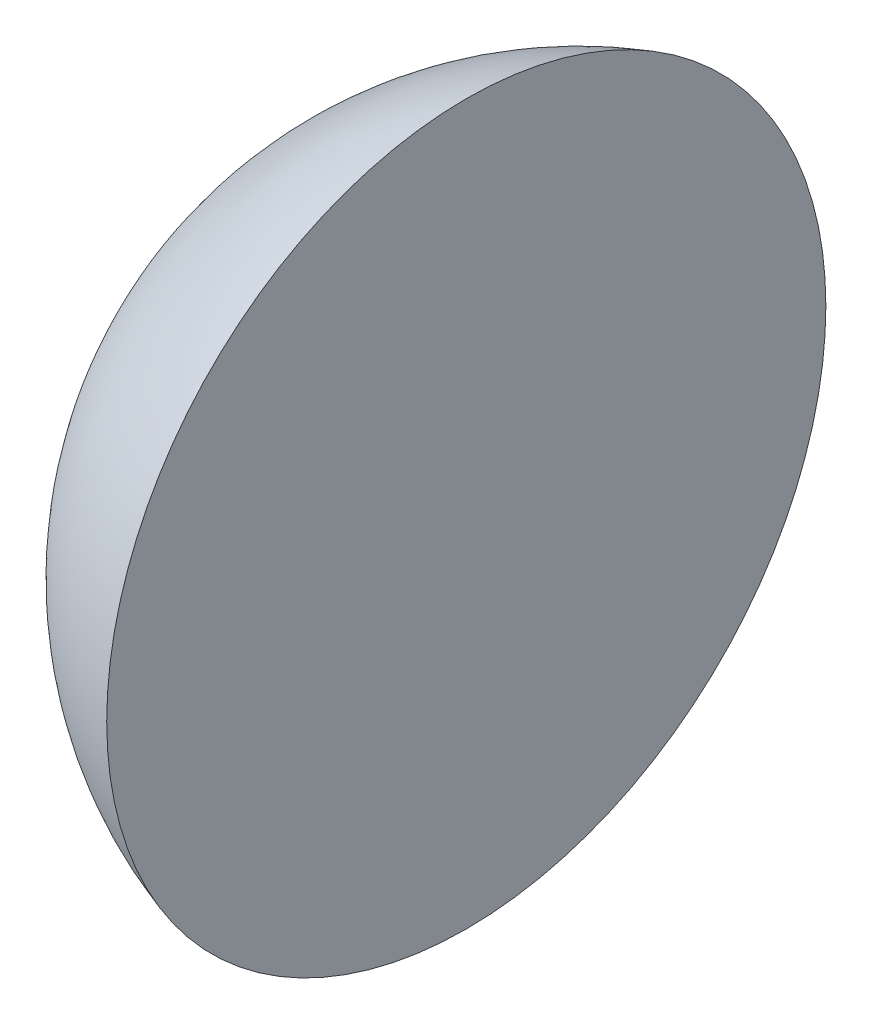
ISO-10303-21;
HEADER;
FILE_DESCRIPTION(('STEP AP214'),'2;1');
FILE_NAME('part.step','',(''),(''),'','','');
FILE_SCHEMA(('AUTOMOTIVE_DESIGN { 1 0 10303 214 1 1 1 1 }'));
ENDSEC;
DATA;
#1=APPLICATION_CONTEXT('core data for automotive mechanical design processes');
#2=APPLICATION_PROTOCOL_DEFINITION('international standard','automotive_design',2000,#1);
#3=PRODUCT_CONTEXT('',#1,'mechanical');
#4=PRODUCT('Part','Part','',(#3));
#5=PRODUCT_RELATED_PRODUCT_CATEGORY('part','',(#4));
#6=PRODUCT_DEFINITION_FORMATION('','',#4);
#7=PRODUCT_DEFINITION_CONTEXT('part definition',#1,'design');
#8=PRODUCT_DEFINITION('design','',#6,#7);
#9=PRODUCT_DEFINITION_SHAPE('','',#8);
#10=(LENGTH_UNIT() NAMED_UNIT(*) SI_UNIT(.MILLI.,.METRE.));
#11=(NAMED_UNIT(*) PLANE_ANGLE_UNIT() SI_UNIT($,.RADIAN.));
#12=(NAMED_UNIT(*) SI_UNIT($,.STERADIAN.) SOLID_ANGLE_UNIT());
#13=UNCERTAINTY_MEASURE_WITH_UNIT(LENGTH_MEASURE(1.E-05),#10,'distance_accuracy_value','');
#14=(GEOMETRIC_REPRESENTATION_CONTEXT(3) GLOBAL_UNCERTAINTY_ASSIGNED_CONTEXT((#13)) GLOBAL_UNIT_ASSIGNED_CONTEXT((#10,
#11,#12)) REPRESENTATION_CONTEXT('',''));
#15=CARTESIAN_POINT('',(0.,0.,0.));
#16=DIRECTION('',(0.,0.,1.));
#17=DIRECTION('',(1.,0.,0.));
#18=AXIS2_PLACEMENT_3D('',#15,#16,#17);
#19=CARTESIAN_POINT('',(53.5442946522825,1.7,0.));
#20=DIRECTION('',(-1.,0.,0.));
#21=DIRECTION('',(0.,0.,1.));
#22=AXIS2_PLACEMENT_3D('',#19,#20,#21);
#23=PLANE('',#22);
#24=CARTESIAN_POINT('',(53.5442946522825,0.,0.));
#25=DIRECTION('',(-1.,0.,0.));
#26=DIRECTION('',(0.,0.,1.));
#27=AXIS2_PLACEMENT_3D('',#24,#25,#26);
#28=CIRCLE('',#27,1.7);
#29=CARTESIAN_POINT('',(53.5442946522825,0.,1.7));
#30=VERTEX_POINT('',#29);
#31=EDGE_CURVE('E10',#30,#30,#28,.T.);
#32=ORIENTED_EDGE('',*,*,#31,.F.);
#33=EDGE_LOOP('',(#32));
#34=FACE_BOUND('',#33,.T.);
#35=ADVANCED_FACE('F35',(#34),#23,.F.);
#36=CARTESIAN_POINT('',(54.0763,0.,0.));
#37=DIRECTION('',(-1.,0.,0.));
#38=DIRECTION('',(0.,1.,0.));
#39=AXIS2_PLACEMENT_3D('',#36,#37,#38);
#40=SPHERICAL_SURFACE('',#39,1.7813);
#41=ORIENTED_EDGE('',*,*,#31,.T.);
#42=EDGE_LOOP('',(#41));
#43=FACE_BOUND('',#42,.T.);
#44=ADVANCED_FACE('F43',(#43),#40,.T.);
#45=CLOSED_SHELL('',(#35,#44));
#46=MANIFOLD_SOLID_BREP('B2',#45);
#47=ADVANCED_BREP_SHAPE_REPRESENTATION('',(#18,#46),#14);
#48=SHAPE_DEFINITION_REPRESENTATION(#9,#47);
ENDSEC;
END-ISO-10303-21;
